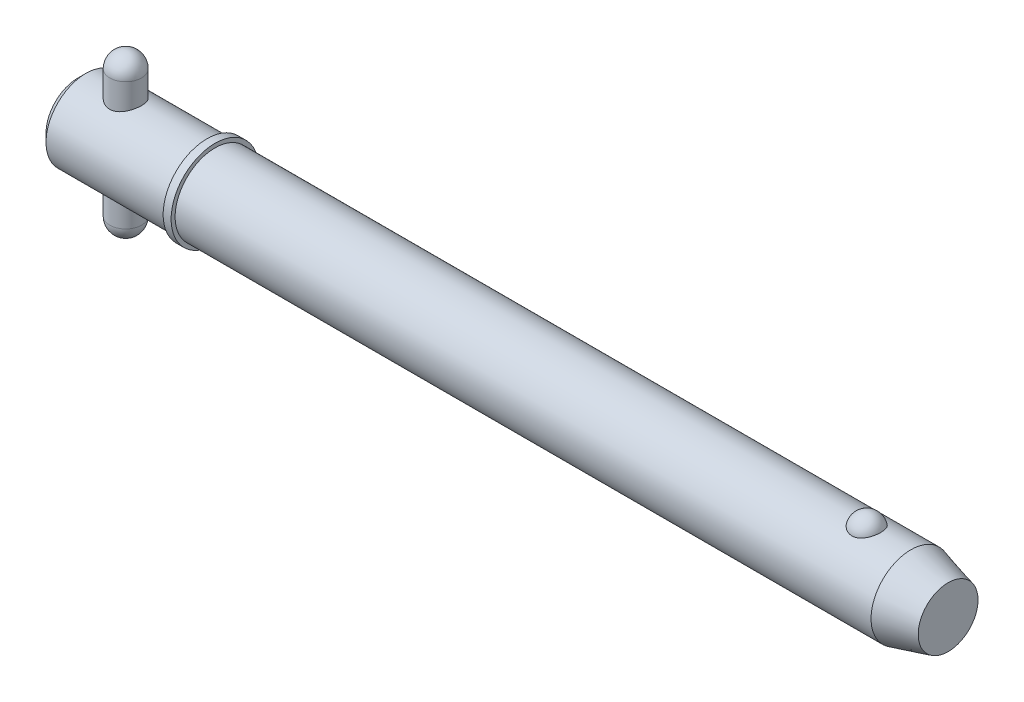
ISO-10303-21;
HEADER;
FILE_DESCRIPTION(('STEP AP214'),'2;1');
FILE_NAME('part.step','',(''),(''),'','','');
FILE_SCHEMA(('AUTOMOTIVE_DESIGN { 1 0 10303 214 1 1 1 1 }'));
ENDSEC;
DATA;
#1=APPLICATION_CONTEXT('core data for automotive mechanical design processes');
#2=APPLICATION_PROTOCOL_DEFINITION('international standard','automotive_design',2000,#1);
#3=PRODUCT_CONTEXT('',#1,'mechanical');
#4=PRODUCT('Part','Part','',(#3));
#5=PRODUCT_RELATED_PRODUCT_CATEGORY('part','',(#4));
#6=PRODUCT_DEFINITION_FORMATION('','',#4);
#7=PRODUCT_DEFINITION_CONTEXT('part definition',#1,'design');
#8=PRODUCT_DEFINITION('design','',#6,#7);
#9=PRODUCT_DEFINITION_SHAPE('','',#8);
#10=(LENGTH_UNIT() NAMED_UNIT(*) SI_UNIT(.MILLI.,.METRE.));
#11=(NAMED_UNIT(*) PLANE_ANGLE_UNIT() SI_UNIT($,.RADIAN.));
#12=(NAMED_UNIT(*) SI_UNIT($,.STERADIAN.) SOLID_ANGLE_UNIT());
#13=UNCERTAINTY_MEASURE_WITH_UNIT(LENGTH_MEASURE(1.E-05),#10,'distance_accuracy_value','');
#14=(GEOMETRIC_REPRESENTATION_CONTEXT(3) GLOBAL_UNCERTAINTY_ASSIGNED_CONTEXT((#13)) GLOBAL_UNIT_ASSIGNED_CONTEXT((#10,
#11,#12)) REPRESENTATION_CONTEXT('',''));
#15=CARTESIAN_POINT('',(0.,0.,0.));
#16=DIRECTION('',(0.,0.,1.));
#17=DIRECTION('',(1.,0.,0.));
#18=AXIS2_PLACEMENT_3D('',#15,#16,#17);
#19=CARTESIAN_POINT('',(9.525,15.875,0.));
#20=DIRECTION('',(0.,-1.,0.));
#21=DIRECTION('',(0.,0.,-1.));
#22=AXIS2_PLACEMENT_3D('',#19,#20,#21);
#23=CYLINDRICAL_SURFACE('',#22,3.175);
#24=CARTESIAN_POINT('',(9.525,-12.7,0.));
#25=DIRECTION('',(0.,-1.,0.));
#26=DIRECTION('',(0.,0.,-1.));
#27=AXIS2_PLACEMENT_3D('',#24,#25,#26);
#28=CIRCLE('',#27,3.175);
#29=CARTESIAN_POINT('',(9.525,-12.7,-3.175));
#30=VERTEX_POINT('',#29);
#31=EDGE_CURVE('P0_E10',#30,#30,#28,.F.);
#32=ORIENTED_EDGE('',*,*,#31,.T.);
#33=EDGE_LOOP('',(#32));
#34=FACE_BOUND('',#33,.T.);
#35=CARTESIAN_POINT('',(9.525,12.7,0.));
#36=DIRECTION('',(0.,-1.,0.));
#37=DIRECTION('',(0.,0.,-1.));
#38=AXIS2_PLACEMENT_3D('',#35,#36,#37);
#39=CIRCLE('',#38,3.175);
#40=CARTESIAN_POINT('',(9.525,12.7,-3.175));
#41=VERTEX_POINT('',#40);
#42=EDGE_CURVE('P0_E21',#41,#41,#39,.T.);
#43=ORIENTED_EDGE('',*,*,#42,.T.);
#44=EDGE_LOOP('',(#43));
#45=FACE_BOUND('',#44,.T.);
#46=ADVANCED_FACE('P0_F14',(#34,#45),#23,.T.);
#47=CARTESIAN_POINT('',(9.525,-12.7,0.));
#48=DIRECTION('',(0.,0.,1.));
#49=DIRECTION('',(1.,0.,0.));
#50=AXIS2_PLACEMENT_3D('',#47,#48,#49);
#51=SPHERICAL_SURFACE('',#50,3.175);
#52=CARTESIAN_POINT('',(9.525,-12.7,0.));
#53=DIRECTION('',(0.,-1.,0.));
#54=DIRECTION('',(0.,0.,-1.));
#55=AXIS2_PLACEMENT_3D('',#52,#53,#54);
#56=SPHERICAL_SURFACE('',#55,3.175);
#57=ORIENTED_EDGE('',*,*,#31,.F.);
#58=EDGE_LOOP('',(#57));
#59=FACE_BOUND('',#58,.T.);
#60=ADVANCED_FACE('P0_F29',(#59),#56,.T.);
#61=CARTESIAN_POINT('',(9.525,12.7,0.));
#62=DIRECTION('',(0.,0.,1.));
#63=DIRECTION('',(1.,0.,0.));
#64=AXIS2_PLACEMENT_3D('',#61,#62,#63);
#65=SPHERICAL_SURFACE('',#64,3.175);
#66=CARTESIAN_POINT('',(9.525,12.7,0.));
#67=DIRECTION('',(0.,-1.,0.));
#68=DIRECTION('',(0.,0.,-1.));
#69=AXIS2_PLACEMENT_3D('',#66,#67,#68);
#70=SPHERICAL_SURFACE('',#69,3.175);
#71=ORIENTED_EDGE('',*,*,#42,.F.);
#72=EDGE_LOOP('',(#71));
#73=FACE_BOUND('',#72,.T.);
#74=ADVANCED_FACE('P0_F16',(#73),#70,.T.);
#75=CLOSED_SHELL('',(#46,#60,#74));
#76=MANIFOLD_SOLID_BREP('P0_B1',#75);
#77=CARTESIAN_POINT('',(0.,0.,0.));
#78=DIRECTION('',(1.,0.,0.));
#79=DIRECTION('',(0.,0.,-1.));
#80=AXIS2_PLACEMENT_3D('',#77,#78,#79);
#81=CYLINDRICAL_SURFACE('',#80,7.94);
#82=CARTESIAN_POINT('',(165.951879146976,0.,0.));
#83=DIRECTION('',(1.,0.,0.));
#84=DIRECTION('',(0.,0.,-1.));
#85=AXIS2_PLACEMENT_3D('',#82,#83,#84);
#86=CIRCLE('',#85,7.94);
#87=CARTESIAN_POINT('',(165.951879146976,0.,-7.94));
#88=VERTEX_POINT('',#87);
#89=EDGE_CURVE('P1_E81',#88,#88,#86,.T.);
#90=ORIENTED_EDGE('',*,*,#89,.F.);
#91=EDGE_LOOP('',(#90));
#92=FACE_BOUND('',#91,.T.);
#93=CARTESIAN_POINT('',(27.31,0.,0.));
#94=DIRECTION('',(1.,0.,0.));
#95=DIRECTION('',(0.,0.,-1.));
#96=AXIS2_PLACEMENT_3D('',#93,#94,#95);
#97=CIRCLE('',#96,7.94);
#98=CARTESIAN_POINT('',(27.31,0.,-7.94));
#99=VERTEX_POINT('',#98);
#100=EDGE_CURVE('P1_E85',#99,#99,#97,.T.);
#101=ORIENTED_EDGE('',*,*,#100,.T.);
#102=EDGE_LOOP('',(#101));
#103=FACE_BOUND('',#102,.T.);
#104=CARTESIAN_POINT('',(157.144907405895,7.37767842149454,2.93486986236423));
#105=CARTESIAN_POINT('',(156.992749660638,7.3776732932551,2.93487505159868));
#106=CARTESIAN_POINT('',(156.840632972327,7.38258419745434,2.92262454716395));
#107=CARTESIAN_POINT('',(156.540928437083,7.40163229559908,2.87404196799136));
#108=CARTESIAN_POINT('',(156.393339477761,7.41576720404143,2.83771585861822));
#109=CARTESIAN_POINT('',(156.107018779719,7.45161576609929,2.74218769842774));
#110=CARTESIAN_POINT('',(155.968274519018,7.47331841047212,2.68301886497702));
#111=CARTESIAN_POINT('',(155.702882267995,7.52194082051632,2.54350967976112));
#112=CARTESIAN_POINT('',(155.576236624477,7.54886159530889,2.46316523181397));
#113=CARTESIAN_POINT('',(155.334534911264,7.60594671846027,2.28090375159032));
#114=CARTESIAN_POINT('',(155.219906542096,7.63618114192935,2.1784421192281));
#115=CARTESIAN_POINT('',(155.008878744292,7.69614046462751,1.95608495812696));
#116=CARTESIAN_POINT('',(154.912482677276,7.72586526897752,1.83618622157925));
#117=CARTESIAN_POINT('',(154.735938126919,7.78314821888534,1.57628086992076));
#118=CARTESIAN_POINT('',(154.656707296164,7.81055035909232,1.43561546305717));
#119=CARTESIAN_POINT('',(154.521797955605,7.85879631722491,1.14236334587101));
#120=CARTESIAN_POINT('',(154.466121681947,7.87963951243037,0.989775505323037));
#121=CARTESIAN_POINT('',(154.37881215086,7.91289645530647,0.674619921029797));
#122=CARTESIAN_POINT('',(154.34753090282,7.92518652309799,0.511941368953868));
#123=CARTESIAN_POINT('',(154.310975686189,7.93958930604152,0.183247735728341));
#124=CARTESIAN_POINT('',(154.305701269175,7.94170219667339,0.0172327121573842));
#125=CARTESIAN_POINT('',(154.321231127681,7.93554931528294,-0.312672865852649));
#126=CARTESIAN_POINT('',(154.341925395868,7.92732732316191,-0.476569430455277));
#127=CARTESIAN_POINT('',(154.40878655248,7.90141534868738,-0.79830524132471));
#128=CARTESIAN_POINT('',(154.454953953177,7.88372517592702,-0.956144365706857));
#129=CARTESIAN_POINT('',(154.571898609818,7.84066230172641,-1.26152073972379));
#130=CARTESIAN_POINT('',(154.642704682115,7.81528060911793,-1.40904568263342));
#131=CARTESIAN_POINT('',(154.807478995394,7.75948672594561,-1.68950598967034));
#132=CARTESIAN_POINT('',(154.901448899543,7.72907417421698,-1.82244030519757));
#133=CARTESIAN_POINT('',(155.110839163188,7.66640424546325,-2.07032792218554));
#134=CARTESIAN_POINT('',(155.226315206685,7.63414223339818,-2.18523308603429));
#135=CARTESIAN_POINT('',(155.4759006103,7.57149681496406,-2.39329737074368));
#136=CARTESIAN_POINT('',(155.610008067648,7.54111321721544,-2.48645870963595));
#137=CARTESIAN_POINT('',(155.890111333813,7.48650742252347,-2.64628132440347));
#138=CARTESIAN_POINT('',(156.035760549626,7.46215900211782,-2.71350554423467));
#139=CARTESIAN_POINT('',(156.337425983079,7.42171253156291,-2.82226614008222));
#140=CARTESIAN_POINT('',(156.493438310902,7.40561140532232,-2.86381209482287));
#141=CARTESIAN_POINT('',(156.802970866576,7.3842679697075,-2.9183907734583));
#142=CARTESIAN_POINT('',(156.956222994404,7.37852109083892,-2.93275024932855));
#143=CARTESIAN_POINT('',(157.263070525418,7.37700973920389,-2.93655208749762));
#144=CARTESIAN_POINT('',(157.416665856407,7.38124333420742,-2.92599927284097));
#145=CARTESIAN_POINT('',(157.714990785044,7.39890635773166,-2.88102897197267));
#146=CARTESIAN_POINT('',(157.859848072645,7.41205491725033,-2.84733999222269));
#147=CARTESIAN_POINT('',(158.14164329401,7.445801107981,-2.75788206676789));
#148=CARTESIAN_POINT('',(158.278580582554,7.46639934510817,-2.70211132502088));
#149=CARTESIAN_POINT('',(158.544061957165,7.51339098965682,-2.56858908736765));
#150=CARTESIAN_POINT('',(158.672354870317,7.53990200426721,-2.4903806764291));
#151=CARTESIAN_POINT('',(158.914244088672,7.59569503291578,-2.31462737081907));
#152=CARTESIAN_POINT('',(159.027837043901,7.6249776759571,-2.21707808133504));
#153=CARTESIAN_POINT('',(159.24322156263,7.68489473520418,-1.99982049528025));
#154=CARTESIAN_POINT('',(159.344148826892,7.71552419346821,-1.87925337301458));
#155=CARTESIAN_POINT('',(159.525186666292,7.77353016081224,-1.6226882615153));
#156=CARTESIAN_POINT('',(159.605293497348,7.80090608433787,-1.48668750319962));
#157=CARTESIAN_POINT('',(159.745361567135,7.85047992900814,-1.1981841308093));
#158=CARTESIAN_POINT('',(159.804587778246,7.87248183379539,-1.04529016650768));
#159=CARTESIAN_POINT('',(159.897982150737,7.90785114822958,-0.731080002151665));
#160=CARTESIAN_POINT('',(159.932149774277,7.92121837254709,-0.569763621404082));
#161=CARTESIAN_POINT('',(159.974795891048,7.93797834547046,-0.242812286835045));
#162=CARTESIAN_POINT('',(159.983204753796,7.94134405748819,-0.0771668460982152));
#163=CARTESIAN_POINT('',(159.973962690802,7.93767937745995,0.253276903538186));
#164=CARTESIAN_POINT('',(159.956312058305,7.93064910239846,0.418075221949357));
#165=CARTESIAN_POINT('',(159.895424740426,7.90695571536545,0.741525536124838));
#166=CARTESIAN_POINT('',(159.852281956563,7.8903279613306,0.900197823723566));
#167=CARTESIAN_POINT('',(159.74135358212,7.84916386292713,1.20759654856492));
#168=CARTESIAN_POINT('',(159.67356656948,7.82462706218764,1.35632241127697));
#169=CARTESIAN_POINT('',(159.514371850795,7.77006699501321,1.64032869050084));
#170=CARTESIAN_POINT('',(159.422861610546,7.74002008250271,1.7755471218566));
#171=CARTESIAN_POINT('',(159.218296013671,7.67774175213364,2.0280064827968));
#172=CARTESIAN_POINT('',(159.105241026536,7.64551037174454,2.14524772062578));
#173=CARTESIAN_POINT('',(158.860831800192,7.58265895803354,2.35778002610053));
#174=CARTESIAN_POINT('',(158.729583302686,7.5520309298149,2.45319004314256));
#175=CARTESIAN_POINT('',(158.451601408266,7.49579792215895,2.61999897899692));
#176=CARTESIAN_POINT('',(158.304867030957,7.4701932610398,2.69139637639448));
#177=CARTESIAN_POINT('',(157.992947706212,7.42622216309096,2.8105324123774));
#178=CARTESIAN_POINT('',(157.827220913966,7.40825002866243,2.85700910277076));
#179=CARTESIAN_POINT('',(157.489279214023,7.38398348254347,2.9191685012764));
#180=CARTESIAN_POINT('',(157.31706702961,7.3776842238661,2.93486399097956));
#181=CARTESIAN_POINT('',(157.144907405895,7.37767842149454,2.93486986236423));
#182=B_SPLINE_CURVE_WITH_KNOTS('',3,(#104,#105,#106,#107,#108,#109,#110,#111,#112,#113,#114,
#115,#116,#117,#118,#119,#120,#121,#122,#123,#124,#125,#126,#127,#128,#129,#130,#131,#132,#133,
#134,#135,#136,#137,#138,#139,#140,#141,#142,#143,#144,#145,#146,#147,#148,#149,#150,#151,#152,
#153,#154,#155,#156,#157,#158,#159,#160,#161,#162,#163,#164,#165,#166,#167,#168,#169,#170,#171,
#172,#173,#174,#175,#176,#177,#178,#179,#180,#181),.UNSPECIFIED.,.T.,.F.,(4,2,2,2,2,2,2,2,2,2,2,
2,2,2,2,2,2,2,2,2,2,2,2,2,2,2,2,2,2,2,2,2,2,2,2,2,2,2,4),(0.,0.455841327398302,
0.911569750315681,1.36663794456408,1.82179423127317,2.2897898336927,2.75787163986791,
3.24685368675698,3.73588214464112,4.23184282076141,4.72779494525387,5.22165321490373,
5.71552141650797,6.20996917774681,6.7044524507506,7.20023431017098,7.69596557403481,
8.18023418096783,8.66432203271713,9.12410697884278,9.58380291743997,10.0296503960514,
10.4755341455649,10.9312349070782,11.3870393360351,11.8654416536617,12.3439299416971,
12.8378875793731,13.3318558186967,13.8271581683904,14.3224549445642,14.8159385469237,
15.3094506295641,15.8051323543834,16.3008055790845,16.7937101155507,17.2866458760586,
17.8026240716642,18.3183879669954),.UNSPECIFIED.);
#183=CARTESIAN_POINT('',(157.144907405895,7.37767842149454,2.93486986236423));
#184=VERTEX_POINT('',#183);
#185=EDGE_CURVE('P1_E35',#184,#184,#182,.T.);
#186=ORIENTED_EDGE('',*,*,#185,.T.);
#187=EDGE_LOOP('',(#186));
#188=FACE_BOUND('',#187,.T.);
#189=ADVANCED_FACE('P1_F13',(#92,#103,#188),#81,.T.);
#190=CARTESIAN_POINT('',(0.,0.,0.));
#191=DIRECTION('',(-1.,0.,0.));
#192=DIRECTION('',(0.,0.,1.));
#193=AXIS2_PLACEMENT_3D('',#190,#191,#192);
#194=PLANE('',#193);
#195=CARTESIAN_POINT('',(0.,0.,0.));
#196=DIRECTION('',(1.,0.,0.));
#197=DIRECTION('',(0.,0.,-1.));
#198=AXIS2_PLACEMENT_3D('',#195,#196,#197);
#199=CIRCLE('',#198,6.352);
#200=CARTESIAN_POINT('',(0.,0.,-6.352));
#201=VERTEX_POINT('',#200);
#202=EDGE_CURVE('P1_E9',#201,#201,#199,.T.);
#203=ORIENTED_EDGE('',*,*,#202,.F.);
#204=EDGE_LOOP('',(#203));
#205=FACE_BOUND('',#204,.T.);
#206=ADVANCED_FACE('P1_F15',(#205),#194,.T.);
#207=CARTESIAN_POINT('',(1.58799999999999,0.,0.));
#208=DIRECTION('',(1.,0.,0.));
#209=DIRECTION('',(0.,0.,-1.));
#210=AXIS2_PLACEMENT_3D('',#207,#208,#209);
#211=CONICAL_SURFACE('',#210,7.94,0.78539816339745);
#212=ORIENTED_EDGE('',*,*,#202,.T.);
#213=EDGE_LOOP('',(#212));
#214=FACE_BOUND('',#213,.T.);
#215=CARTESIAN_POINT('',(1.58799999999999,0.,0.));
#216=DIRECTION('',(1.,0.,0.));
#217=DIRECTION('',(0.,0.,-1.));
#218=AXIS2_PLACEMENT_3D('',#215,#216,#217);
#219=CIRCLE('',#218,7.94);
#220=CARTESIAN_POINT('',(1.58799999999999,0.,-7.94));
#221=VERTEX_POINT('',#220);
#222=EDGE_CURVE('P1_E26',#221,#221,#219,.T.);
#223=ORIENTED_EDGE('',*,*,#222,.F.);
#224=EDGE_LOOP('',(#223));
#225=FACE_BOUND('',#224,.T.);
#226=ADVANCED_FACE('P1_F77',(#214,#225),#211,.T.);
#227=CARTESIAN_POINT('',(0.,0.,0.));
#228=DIRECTION('',(1.,0.,0.));
#229=DIRECTION('',(0.,0.,-1.));
#230=AXIS2_PLACEMENT_3D('',#227,#228,#229);
#231=CYLINDRICAL_SURFACE('',#230,7.94);
#232=CARTESIAN_POINT('',(9.525,-7.27756655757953,3.175));
#233=CARTESIAN_POINT('',(9.43992346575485,-7.27756715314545,3.17499935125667));
#234=CARTESIAN_POINT('',(9.35481882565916,-7.27906496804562,3.1715736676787));
#235=CARTESIAN_POINT('',(9.18524505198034,-7.28499816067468,3.15791803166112));
#236=CARTESIAN_POINT('',(9.100776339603,-7.28943533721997,3.14768391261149));
#237=CARTESIAN_POINT('',(8.84895715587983,-7.30698881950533,3.10684226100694));
#238=CARTESIAN_POINT('',(8.6834173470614,-7.32434654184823,3.06609574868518));
#239=CARTESIAN_POINT('',(8.36278910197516,-7.36806950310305,2.95945910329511));
#240=CARTESIAN_POINT('',(8.20766386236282,-7.39440078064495,2.89366366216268));
#241=CARTESIAN_POINT('',(7.91065319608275,-7.45304562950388,2.73907413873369));
#242=CARTESIAN_POINT('',(7.76876488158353,-7.48535789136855,2.65028508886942));
#243=CARTESIAN_POINT('',(7.49411086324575,-7.55439482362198,2.44679888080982));
#244=CARTESIAN_POINT('',(7.36219910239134,-7.59126138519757,2.33099745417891));
#245=CARTESIAN_POINT('',(7.11904234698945,-7.66408045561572,2.07909838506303));
#246=CARTESIAN_POINT('',(7.00780457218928,-7.70003264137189,1.94299368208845));
#247=CARTESIAN_POINT('',(6.80492173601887,-7.76867514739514,1.64775981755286));
#248=CARTESIAN_POINT('',(6.71422139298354,-7.80118112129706,1.48793473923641));
#249=CARTESIAN_POINT('',(6.56135788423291,-7.85754918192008,1.15376269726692));
#250=CARTESIAN_POINT('',(6.49918311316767,-7.88141478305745,0.979421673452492));
#251=CARTESIAN_POINT('',(6.40818142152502,-7.91680873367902,0.630115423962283));
#252=CARTESIAN_POINT('',(6.3778864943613,-7.9288781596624,0.455588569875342));
#253=CARTESIAN_POINT('',(6.34677743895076,-7.94127547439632,0.103539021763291));
#254=CARTESIAN_POINT('',(6.34595232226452,-7.94160773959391,-0.0739825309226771));
#255=CARTESIAN_POINT('',(6.37300128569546,-7.93082261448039,-0.416371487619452));
#256=CARTESIAN_POINT('',(6.39926693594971,-7.92034690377,-0.581389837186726));
#257=CARTESIAN_POINT('',(6.47701615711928,-7.88998770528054,-0.904449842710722));
#258=CARTESIAN_POINT('',(6.52850157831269,-7.87010352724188,-1.06249098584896));
#259=CARTESIAN_POINT('',(6.65586120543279,-7.82249343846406,-1.36995769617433));
#260=CARTESIAN_POINT('',(6.73209124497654,-7.79465387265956,-1.51921754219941));
#261=CARTESIAN_POINT('',(6.90644286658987,-7.73389606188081,-1.80321183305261));
#262=CARTESIAN_POINT('',(7.00457194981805,-7.70097607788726,-1.93794127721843));
#263=CARTESIAN_POINT('',(7.22744086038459,-7.63084889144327,-2.19843606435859));
#264=CARTESIAN_POINT('',(7.35350432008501,-7.59350211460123,-2.3230330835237));
#265=CARTESIAN_POINT('',(7.62488266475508,-7.52039654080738,-2.54979642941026));
#266=CARTESIAN_POINT('',(7.77020381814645,-7.48463826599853,-2.65195542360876));
#267=CARTESIAN_POINT('',(8.08119298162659,-7.41780943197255,-2.83361305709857));
#268=CARTESIAN_POINT('',(8.24731937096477,-7.38689959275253,-2.91239105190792));
#269=CARTESIAN_POINT('',(8.59204539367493,-7.33515216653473,-3.04038913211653));
#270=CARTESIAN_POINT('',(8.77063684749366,-7.31430804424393,-3.08962840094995));
#271=CARTESIAN_POINT('',(9.12356982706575,-7.28663831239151,-3.15431018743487));
#272=CARTESIAN_POINT('',(9.29750494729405,-7.2790344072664,-3.17163284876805));
#273=CARTESIAN_POINT('',(9.64592502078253,-7.27648884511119,-3.17747282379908));
#274=CARTESIAN_POINT('',(9.82040979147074,-7.28154335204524,-3.16599886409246));
#275=CARTESIAN_POINT('',(10.1545374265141,-7.30294638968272,-3.11628310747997));
#276=CARTESIAN_POINT('',(10.3144598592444,-7.31863587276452,-3.0796016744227));
#277=CARTESIAN_POINT('',(10.625774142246,-7.35872371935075,-2.98253618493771));
#278=CARTESIAN_POINT('',(10.7771640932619,-7.38312401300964,-2.92214687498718));
#279=CARTESIAN_POINT('',(11.0739599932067,-7.4390944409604,-2.77664664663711));
#280=CARTESIAN_POINT('',(11.2188745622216,-7.47091513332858,-2.69063278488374));
#281=CARTESIAN_POINT('',(11.4928722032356,-7.53775867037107,-2.49724834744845));
#282=CARTESIAN_POINT('',(11.6219487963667,-7.57278281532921,-2.38986907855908));
#283=CARTESIAN_POINT('',(11.8705091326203,-7.64520845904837,-2.1474449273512));
#284=CARTESIAN_POINT('',(11.9885816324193,-7.68259462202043,-2.01094304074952));
#285=CARTESIAN_POINT('',(12.2003631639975,-7.75309951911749,-1.71917041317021));
#286=CARTESIAN_POINT('',(12.2940712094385,-7.78621808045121,-1.56389891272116));
#287=CARTESIAN_POINT('',(12.4541161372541,-7.84456050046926,-1.23845027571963));
#288=CARTESIAN_POINT('',(12.5204600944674,-7.86978639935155,-1.06827700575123));
#289=CARTESIAN_POINT('',(12.6231407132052,-7.90943635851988,-0.717928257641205));
#290=CARTESIAN_POINT('',(12.6594936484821,-7.92386627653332,-0.537758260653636));
#291=CARTESIAN_POINT('',(12.6992281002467,-7.93967263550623,-0.185201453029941));
#292=CARTESIAN_POINT('',(12.7046050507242,-7.94183891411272,-0.0130732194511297));
#293=CARTESIAN_POINT('',(12.6875036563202,-7.9350072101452,0.329549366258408));
#294=CARTESIAN_POINT('',(12.6650295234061,-7.92601091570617,0.500043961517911));
#295=CARTESIAN_POINT('',(12.5942896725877,-7.89825976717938,0.829196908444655));
#296=CARTESIAN_POINT('',(12.5468364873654,-7.87981280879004,0.988057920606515));
#297=CARTESIAN_POINT('',(12.4283390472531,-7.83513565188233,1.29553461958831));
#298=CARTESIAN_POINT('',(12.3572904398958,-7.8089040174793,1.44414841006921));
#299=CARTESIAN_POINT('',(12.1900822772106,-7.7497911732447,1.73412879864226));
#300=CARTESIAN_POINT('',(12.0929519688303,-7.71666737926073,1.87488510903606));
#301=CARTESIAN_POINT('',(11.8777894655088,-7.64775894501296,2.13869231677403));
#302=CARTESIAN_POINT('',(11.7597486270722,-7.61197320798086,2.26173585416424));
#303=CARTESIAN_POINT('',(11.4974896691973,-7.53902341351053,2.49449755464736));
#304=CARTESIAN_POINT('',(11.3521039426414,-7.50191102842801,2.60292060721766));
#305=CARTESIAN_POINT('',(11.0440201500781,-7.43289551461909,2.79392602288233));
#306=CARTESIAN_POINT('',(10.8813200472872,-7.40099299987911,2.87650534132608));
#307=CARTESIAN_POINT('',(10.558064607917,-7.3489506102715,3.00682739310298));
#308=CARTESIAN_POINT('',(10.398627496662,-7.32801197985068,3.05703164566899));
#309=CARTESIAN_POINT('',(10.0731242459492,-7.29639491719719,3.13175843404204));
#310=CARTESIAN_POINT('',(9.90707793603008,-7.28568789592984,3.15635254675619));
#311=CARTESIAN_POINT('',(9.70441566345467,-7.27968826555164,3.17013149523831));
#312=CARTESIAN_POINT('',(9.66856669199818,-7.27889378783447,3.17195593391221));
#313=CARTESIAN_POINT('',(9.59681348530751,-7.27783278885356,3.17439036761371));
#314=CARTESIAN_POINT('',(9.56090924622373,-7.27756630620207,3.17500027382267));
#315=CARTESIAN_POINT('',(9.525,-7.27756655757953,3.175));
#316=B_SPLINE_CURVE_WITH_KNOTS('',3,(#232,#233,#234,#235,#236,#237,#238,#239,#240,#241,#242,
#243,#244,#245,#246,#247,#248,#249,#250,#251,#252,#253,#254,#255,#256,#257,#258,#259,#260,#261,
#262,#263,#264,#265,#266,#267,#268,#269,#270,#271,#272,#273,#274,#275,#276,#277,#278,#279,#280,
#281,#282,#283,#284,#285,#286,#287,#288,#289,#290,#291,#292,#293,#294,#295,#296,#297,#298,#299,
#300,#301,#302,#303,#304,#305,#306,#307,#308,#309,#310,#311,#312,#313,#314,#315),.UNSPECIFIED.,
.T.,.F.,(4,2,2,2,2,2,2,2,2,2,2,2,2,2,2,2,2,2,2,2,2,2,2,2,2,2,2,2,2,2,2,2,2,2,2,2,2,2,2,2,2,4),
(0.,0.255187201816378,0.510530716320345,1.0218798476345,1.53131482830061,2.04063840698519,
2.57635929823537,3.11226692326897,3.66929090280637,4.22608806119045,4.75594400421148,
5.28560237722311,5.78552836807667,6.28549104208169,6.79298787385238,7.30065880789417,
7.8416422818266,8.38280228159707,8.93923025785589,9.49529647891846,10.0174074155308,
10.5393601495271,11.0316114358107,11.5239718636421,12.0362920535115,12.5488211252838,
13.0991799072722,13.6495609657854,14.1997996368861,14.7497395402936,15.2638187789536,
15.7778202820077,16.2760504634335,16.7743726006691,17.294711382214,17.8152657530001,
18.3680208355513,18.9208410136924,19.4240423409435,19.9258334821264,20.0335354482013,
20.1412452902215),.UNSPECIFIED.);
#317=CARTESIAN_POINT('',(9.525,-7.27756655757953,3.175));
#318=VERTEX_POINT('',#317);
#319=EDGE_CURVE('P1_E17',#318,#318,#316,.T.);
#320=ORIENTED_EDGE('',*,*,#319,.F.);
#321=EDGE_LOOP('',(#320));
#322=FACE_BOUND('',#321,.T.);
#323=CARTESIAN_POINT('',(9.525,7.27756655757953,3.175));
#324=CARTESIAN_POINT('',(9.61007653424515,7.27756715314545,3.17499935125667));
#325=CARTESIAN_POINT('',(9.69518117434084,7.27906496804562,3.1715736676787));
#326=CARTESIAN_POINT('',(9.86475494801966,7.28499816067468,3.15791803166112));
#327=CARTESIAN_POINT('',(9.949223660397,7.28943533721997,3.14768391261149));
#328=CARTESIAN_POINT('',(10.2010428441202,7.30698881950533,3.10684226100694));
#329=CARTESIAN_POINT('',(10.3665826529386,7.32434654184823,3.06609574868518));
#330=CARTESIAN_POINT('',(10.6872108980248,7.36806950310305,2.95945910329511));
#331=CARTESIAN_POINT('',(10.8423361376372,7.39440078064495,2.89366366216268));
#332=CARTESIAN_POINT('',(11.1393468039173,7.45304562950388,2.73907413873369));
#333=CARTESIAN_POINT('',(11.2812351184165,7.48535789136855,2.65028508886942));
#334=CARTESIAN_POINT('',(11.5558891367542,7.55439482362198,2.44679888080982));
#335=CARTESIAN_POINT('',(11.6878008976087,7.59126138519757,2.33099745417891));
#336=CARTESIAN_POINT('',(11.9309576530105,7.66408045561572,2.07909838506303));
#337=CARTESIAN_POINT('',(12.0421954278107,7.70003264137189,1.94299368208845));
#338=CARTESIAN_POINT('',(12.2450782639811,7.76867514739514,1.64775981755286));
#339=CARTESIAN_POINT('',(12.3357786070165,7.80118112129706,1.48793473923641));
#340=CARTESIAN_POINT('',(12.4886421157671,7.85754918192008,1.15376269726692));
#341=CARTESIAN_POINT('',(12.5508168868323,7.88141478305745,0.979421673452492));
#342=CARTESIAN_POINT('',(12.641818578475,7.91680873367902,0.630115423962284));
#343=CARTESIAN_POINT('',(12.6721135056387,7.9288781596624,0.455588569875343));
#344=CARTESIAN_POINT('',(12.7032225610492,7.94127547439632,0.103539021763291));
#345=CARTESIAN_POINT('',(12.7040476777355,7.94160773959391,-0.0739825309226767));
#346=CARTESIAN_POINT('',(12.6769987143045,7.93082261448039,-0.416371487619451));
#347=CARTESIAN_POINT('',(12.6507330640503,7.92034690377,-0.581389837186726));
#348=CARTESIAN_POINT('',(12.5729838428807,7.88998770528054,-0.904449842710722));
#349=CARTESIAN_POINT('',(12.5214984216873,7.87010352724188,-1.06249098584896));
#350=CARTESIAN_POINT('',(12.3941387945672,7.82249343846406,-1.36995769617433));
#351=CARTESIAN_POINT('',(12.3179087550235,7.79465387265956,-1.51921754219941));
#352=CARTESIAN_POINT('',(12.1435571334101,7.73389606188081,-1.80321183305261));
#353=CARTESIAN_POINT('',(12.0454280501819,7.70097607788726,-1.93794127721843));
#354=CARTESIAN_POINT('',(11.8225591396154,7.63084889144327,-2.19843606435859));
#355=CARTESIAN_POINT('',(11.696495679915,7.59350211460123,-2.3230330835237));
#356=CARTESIAN_POINT('',(11.4251173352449,7.52039654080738,-2.54979642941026));
#357=CARTESIAN_POINT('',(11.2797961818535,7.48463826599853,-2.65195542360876));
#358=CARTESIAN_POINT('',(10.9688070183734,7.41780943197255,-2.83361305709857));
#359=CARTESIAN_POINT('',(10.8026806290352,7.38689959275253,-2.91239105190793));
#360=CARTESIAN_POINT('',(10.4579546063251,7.33515216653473,-3.04038913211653));
#361=CARTESIAN_POINT('',(10.2793631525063,7.31430804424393,-3.08962840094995));
#362=CARTESIAN_POINT('',(9.92643017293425,7.28663831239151,-3.15431018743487));
#363=CARTESIAN_POINT('',(9.75249505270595,7.2790344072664,-3.17163284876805));
#364=CARTESIAN_POINT('',(9.40407497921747,7.2764888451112,-3.17747282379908));
#365=CARTESIAN_POINT('',(9.22959020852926,7.28154335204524,-3.16599886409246));
#366=CARTESIAN_POINT('',(8.89546257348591,7.30294638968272,-3.11628310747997));
#367=CARTESIAN_POINT('',(8.73554014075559,7.31863587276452,-3.0796016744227));
#368=CARTESIAN_POINT('',(8.42422585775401,7.35872371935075,-2.98253618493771));
#369=CARTESIAN_POINT('',(8.27283590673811,7.38312401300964,-2.92214687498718));
#370=CARTESIAN_POINT('',(7.97604000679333,7.4390944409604,-2.77664664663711));
#371=CARTESIAN_POINT('',(7.83112543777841,7.47091513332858,-2.69063278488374));
#372=CARTESIAN_POINT('',(7.55712779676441,7.53775867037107,-2.49724834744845));
#373=CARTESIAN_POINT('',(7.42805120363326,7.57278281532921,-2.38986907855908));
#374=CARTESIAN_POINT('',(7.17949086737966,7.64520845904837,-2.1474449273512));
#375=CARTESIAN_POINT('',(7.06141836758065,7.68259462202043,-2.01094304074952));
#376=CARTESIAN_POINT('',(6.8496368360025,7.75309951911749,-1.71917041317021));
#377=CARTESIAN_POINT('',(6.75592879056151,7.78621808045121,-1.56389891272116));
#378=CARTESIAN_POINT('',(6.59588386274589,7.84456050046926,-1.23845027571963));
#379=CARTESIAN_POINT('',(6.52953990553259,7.86978639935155,-1.06827700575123));
#380=CARTESIAN_POINT('',(6.42685928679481,7.90943635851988,-0.717928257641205));
#381=CARTESIAN_POINT('',(6.39050635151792,7.92386627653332,-0.537758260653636));
#382=CARTESIAN_POINT('',(6.35077189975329,7.93967263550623,-0.18520145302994));
#383=CARTESIAN_POINT('',(6.34539494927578,7.94183891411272,-0.0130732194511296));
#384=CARTESIAN_POINT('',(6.36249634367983,7.9350072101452,0.329549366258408));
#385=CARTESIAN_POINT('',(6.38497047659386,7.92601091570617,0.500043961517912));
#386=CARTESIAN_POINT('',(6.45571032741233,7.89825976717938,0.829196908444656));
#387=CARTESIAN_POINT('',(6.50316351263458,7.87981280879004,0.988057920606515));
#388=CARTESIAN_POINT('',(6.62166095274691,7.83513565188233,1.29553461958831));
#389=CARTESIAN_POINT('',(6.69270956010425,7.8089040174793,1.44414841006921));
#390=CARTESIAN_POINT('',(6.85991772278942,7.7497911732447,1.73412879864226));
#391=CARTESIAN_POINT('',(6.95704803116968,7.71666737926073,1.87488510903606));
#392=CARTESIAN_POINT('',(7.17221053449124,7.64775894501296,2.13869231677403));
#393=CARTESIAN_POINT('',(7.29025137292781,7.61197320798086,2.26173585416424));
#394=CARTESIAN_POINT('',(7.55251033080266,7.53902341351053,2.49449755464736));
#395=CARTESIAN_POINT('',(7.69789605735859,7.50191102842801,2.60292060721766));
#396=CARTESIAN_POINT('',(8.00597984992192,7.43289551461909,2.79392602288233));
#397=CARTESIAN_POINT('',(8.16867995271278,7.40099299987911,2.87650534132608));
#398=CARTESIAN_POINT('',(8.49193539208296,7.3489506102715,3.00682739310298));
#399=CARTESIAN_POINT('',(8.65137250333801,7.32801197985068,3.05703164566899));
#400=CARTESIAN_POINT('',(8.97687575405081,7.29639491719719,3.13175843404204));
#401=CARTESIAN_POINT('',(9.14292206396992,7.28568789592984,3.15635254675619));
#402=CARTESIAN_POINT('',(9.34558433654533,7.27968826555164,3.17013149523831));
#403=CARTESIAN_POINT('',(9.38143330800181,7.27889378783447,3.17195593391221));
#404=CARTESIAN_POINT('',(9.45318651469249,7.27783278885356,3.17439036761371));
#405=CARTESIAN_POINT('',(9.48909075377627,7.27756630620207,3.17500027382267));
#406=CARTESIAN_POINT('',(9.525,7.27756655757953,3.175));
#407=B_SPLINE_CURVE_WITH_KNOTS('',3,(#323,#324,#325,#326,#327,#328,#329,#330,#331,#332,#333,
#334,#335,#336,#337,#338,#339,#340,#341,#342,#343,#344,#345,#346,#347,#348,#349,#350,#351,#352,
#353,#354,#355,#356,#357,#358,#359,#360,#361,#362,#363,#364,#365,#366,#367,#368,#369,#370,#371,
#372,#373,#374,#375,#376,#377,#378,#379,#380,#381,#382,#383,#384,#385,#386,#387,#388,#389,#390,
#391,#392,#393,#394,#395,#396,#397,#398,#399,#400,#401,#402,#403,#404,#405,#406),.UNSPECIFIED.,
.T.,.F.,(4,2,2,2,2,2,2,2,2,2,2,2,2,2,2,2,2,2,2,2,2,2,2,2,2,2,2,2,2,2,2,2,2,2,2,2,2,2,2,2,2,4),
(0.,0.255187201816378,0.510530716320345,1.0218798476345,1.53131482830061,2.04063840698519,
2.57635929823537,3.11226692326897,3.66929090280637,4.22608806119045,4.75594400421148,
5.2856023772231,5.78552836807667,6.28549104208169,6.79298787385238,7.30065880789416,
7.8416422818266,8.38280228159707,8.9392302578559,9.49529647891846,10.0174074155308,
10.5393601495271,11.0316114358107,11.5239718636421,12.0362920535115,12.5488211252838,
13.0991799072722,13.6495609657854,14.1997996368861,14.7497395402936,15.2638187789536,
15.7778202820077,16.2760504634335,16.7743726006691,17.294711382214,17.8152657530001,
18.3680208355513,18.9208410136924,19.4240423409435,19.9258334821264,20.0335354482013,
20.1412452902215),.UNSPECIFIED.);
#408=CARTESIAN_POINT('',(9.525,7.27756655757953,3.175));
#409=VERTEX_POINT('',#408);
#410=EDGE_CURVE('P1_E43',#409,#409,#407,.T.);
#411=ORIENTED_EDGE('',*,*,#410,.F.);
#412=EDGE_LOOP('',(#411));
#413=FACE_BOUND('',#412,.T.);
#414=ORIENTED_EDGE('',*,*,#222,.T.);
#415=EDGE_LOOP('',(#414));
#416=FACE_BOUND('',#415,.T.);
#417=CARTESIAN_POINT('',(25.722,0.,0.));
#418=DIRECTION('',(1.,0.,0.));
#419=DIRECTION('',(0.,0.,-1.));
#420=AXIS2_PLACEMENT_3D('',#417,#418,#419);
#421=CIRCLE('',#420,7.94);
#422=CARTESIAN_POINT('',(25.722,0.,-7.94));
#423=VERTEX_POINT('',#422);
#424=EDGE_CURVE('P1_E31',#423,#423,#421,.T.);
#425=ORIENTED_EDGE('',*,*,#424,.F.);
#426=EDGE_LOOP('',(#425));
#427=FACE_BOUND('',#426,.T.);
#428=ADVANCED_FACE('P1_F103',(#322,#413,#416,#427),#231,.T.);
#429=CARTESIAN_POINT('',(25.722,7.94,0.));
#430=DIRECTION('',(-1.,0.,0.));
#431=DIRECTION('',(0.,0.,1.));
#432=AXIS2_PLACEMENT_3D('',#429,#430,#431);
#433=PLANE('',#432);
#434=ORIENTED_EDGE('',*,*,#424,.T.);
#435=EDGE_LOOP('',(#434));
#436=FACE_BOUND('',#435,.T.);
#437=CARTESIAN_POINT('',(25.722,0.,0.));
#438=DIRECTION('',(1.,0.,0.));
#439=DIRECTION('',(0.,0.,-1.));
#440=AXIS2_PLACEMENT_3D('',#437,#438,#439);
#441=CIRCLE('',#440,8.734);
#442=CARTESIAN_POINT('',(25.722,0.,-8.734));
#443=VERTEX_POINT('',#442);
#444=EDGE_CURVE('P1_E91',#443,#443,#441,.T.);
#445=ORIENTED_EDGE('',*,*,#444,.F.);
#446=EDGE_LOOP('',(#445));
#447=FACE_BOUND('',#446,.T.);
#448=ADVANCED_FACE('P1_F100',(#436,#447),#433,.T.);
#449=CARTESIAN_POINT('',(0.,0.,0.));
#450=DIRECTION('',(1.,0.,0.));
#451=DIRECTION('',(0.,0.,-1.));
#452=AXIS2_PLACEMENT_3D('',#449,#450,#451);
#453=CYLINDRICAL_SURFACE('',#452,8.734);
#454=ORIENTED_EDGE('',*,*,#444,.T.);
#455=EDGE_LOOP('',(#454));
#456=FACE_BOUND('',#455,.T.);
#457=CARTESIAN_POINT('',(27.31,0.,0.));
#458=DIRECTION('',(1.,0.,0.));
#459=DIRECTION('',(0.,0.,-1.));
#460=AXIS2_PLACEMENT_3D('',#457,#458,#459);
#461=CIRCLE('',#460,8.734);
#462=CARTESIAN_POINT('',(27.31,0.,-8.734));
#463=VERTEX_POINT('',#462);
#464=EDGE_CURVE('P1_E88',#463,#463,#461,.T.);
#465=ORIENTED_EDGE('',*,*,#464,.F.);
#466=EDGE_LOOP('',(#465));
#467=FACE_BOUND('',#466,.T.);
#468=ADVANCED_FACE('P1_F68',(#456,#467),#453,.T.);
#469=CARTESIAN_POINT('',(27.31,8.734,0.));
#470=DIRECTION('',(1.,0.,0.));
#471=DIRECTION('',(0.,0.,-1.));
#472=AXIS2_PLACEMENT_3D('',#469,#470,#471);
#473=PLANE('',#472);
#474=ORIENTED_EDGE('',*,*,#464,.T.);
#475=EDGE_LOOP('',(#474));
#476=FACE_BOUND('',#475,.T.);
#477=ORIENTED_EDGE('',*,*,#100,.F.);
#478=EDGE_LOOP('',(#477));
#479=FACE_BOUND('',#478,.T.);
#480=ADVANCED_FACE('P1_F62',(#476,#479),#473,.T.);
#481=CARTESIAN_POINT('',(173.36,0.,0.));
#482=DIRECTION('',(-1.,0.,0.));
#483=DIRECTION('',(0.,0.,1.));
#484=AXIS2_PLACEMENT_3D('',#481,#482,#483);
#485=CONICAL_SURFACE('',#484,5.95500000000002,0.26179938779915);
#486=ORIENTED_EDGE('',*,*,#89,.T.);
#487=EDGE_LOOP('',(#486));
#488=FACE_BOUND('',#487,.T.);
#489=CARTESIAN_POINT('',(173.36,0.,0.));
#490=DIRECTION('',(1.,0.,0.));
#491=DIRECTION('',(0.,0.,-1.));
#492=AXIS2_PLACEMENT_3D('',#489,#490,#491);
#493=CIRCLE('',#492,5.95500000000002);
#494=CARTESIAN_POINT('',(173.36,0.,-5.95500000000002));
#495=VERTEX_POINT('',#494);
#496=EDGE_CURVE('P1_E42',#495,#495,#493,.T.);
#497=ORIENTED_EDGE('',*,*,#496,.F.);
#498=EDGE_LOOP('',(#497));
#499=FACE_BOUND('',#498,.T.);
#500=ADVANCED_FACE('P1_F59',(#488,#499),#485,.T.);
#501=CARTESIAN_POINT('',(173.36,5.95500000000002,0.));
#502=DIRECTION('',(1.,0.,0.));
#503=DIRECTION('',(0.,0.,-1.));
#504=AXIS2_PLACEMENT_3D('',#501,#502,#503);
#505=PLANE('',#504);
#506=ORIENTED_EDGE('',*,*,#496,.T.);
#507=EDGE_LOOP('',(#506));
#508=FACE_BOUND('',#507,.T.);
#509=ADVANCED_FACE('P1_F55',(#508),#505,.T.);
#510=CARTESIAN_POINT('',(157.144907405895,7.146,0.));
#511=DIRECTION('',(-1.,0.,0.));
#512=DIRECTION('',(0.,1.,0.));
#513=AXIS2_PLACEMENT_3D('',#510,#511,#512);
#514=SPHERICAL_SURFACE('',#513,2.944);
#515=ORIENTED_EDGE('',*,*,#185,.F.);
#516=EDGE_LOOP('',(#515));
#517=FACE_BOUND('',#516,.T.);
#518=ADVANCED_FACE('P1_F50',(#517),#514,.T.);
#519=CARTESIAN_POINT('',(9.525,-8.734,0.));
#520=DIRECTION('',(0.,1.,0.));
#521=DIRECTION('',(0.,0.,1.));
#522=AXIS2_PLACEMENT_3D('',#519,#520,#521);
#523=CYLINDRICAL_SURFACE('',#522,3.175);
#524=ORIENTED_EDGE('',*,*,#319,.T.);
#525=EDGE_LOOP('',(#524));
#526=FACE_BOUND('',#525,.T.);
#527=ORIENTED_EDGE('',*,*,#410,.T.);
#528=EDGE_LOOP('',(#527));
#529=FACE_BOUND('',#528,.T.);
#530=ADVANCED_FACE('P1_F54',(#526,#529),#523,.F.);
#531=CLOSED_SHELL('',(#189,#206,#226,#428,#448,#468,#480,#500,#509,#518,#530));
#532=MANIFOLD_SOLID_BREP('P1_B1',#531);
#533=ADVANCED_BREP_SHAPE_REPRESENTATION('',(#18,#76,#532),#14);
#534=SHAPE_DEFINITION_REPRESENTATION(#9,#533);
ENDSEC;
END-ISO-10303-21;
